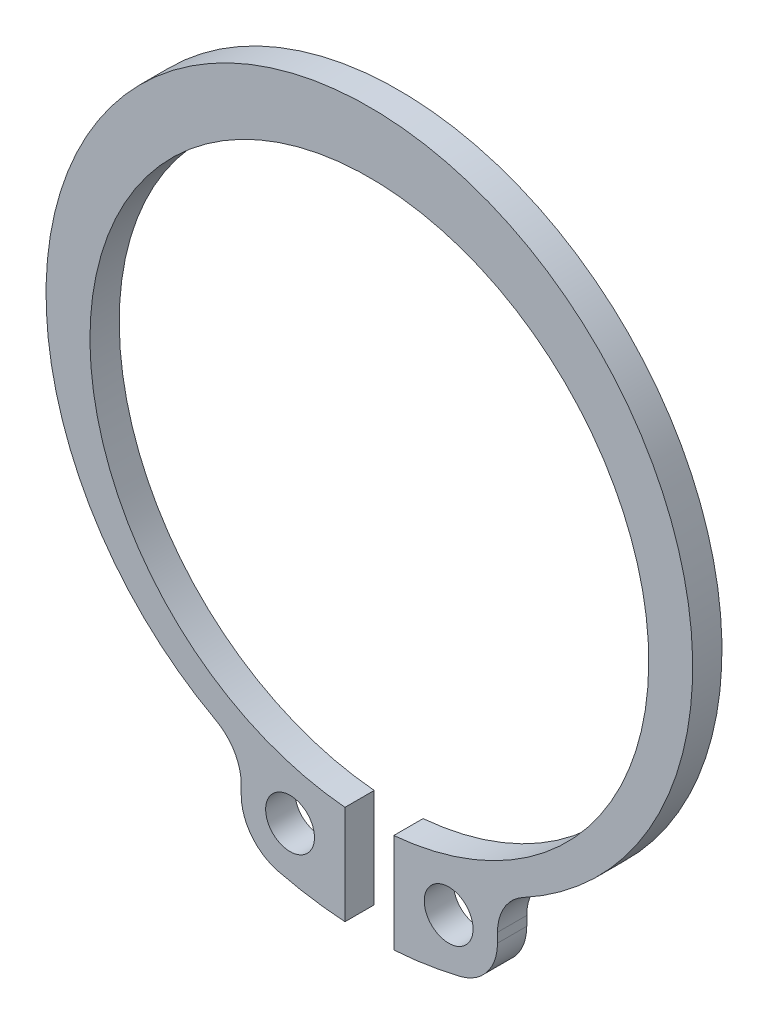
from build123d import *

# Parameters (mm, degrees)
ESQUISSE1_R          = 1
BASE_EXTRUSION_DEPTH = 1.2


with BuildPart() as part:
    # Esquisse1 → Base-Extrusion (new body)
    with BuildSketch(Plane.XY):
        with BuildLine():
            Line((-1, -11.406248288), (-1, -15.467708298))
            ThreePointArc((-1, -15.467708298), (-2.37520157, -15.316932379), (-3.731481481, -15.044136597))
            ThreePointArc((-3.731481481, -15.044136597), (-4.825271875, -14.335239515), (-5.25, -13.102957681))
            Line((-5.25, -13.102957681), (-5.25, -12.716407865))
            ThreePointArc((-5.25, -12.716407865), (-5.532204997, -11.692112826), (-6.299180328, -10.956878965))
            ThreePointArc((-6.299180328, -10.956878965), (0, 13.95), (6.299180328, -10.956878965))
            ThreePointArc((6.299180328, -10.956878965), (5.532204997, -11.692112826), (5.25, -12.716407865))
            Line((5.25, -12.716407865), (5.25, -13.102957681))
            ThreePointArc((5.25, -13.102957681), (4.825271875, -14.335239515), (3.731481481, -15.044136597))
            ThreePointArc((3.731481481, -15.044136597), (2.37520157, -15.316932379), (1, -15.467708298))
            Line((1, -15.467708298), (1, -11.406248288))
            ThreePointArc((1, -11.406248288), (0, 11.45), (-1, -11.406248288))
        make_face()
        with Locations((3.25, -13.102957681)):
            Circle(ESQUISSE1_R, mode=Mode.SUBTRACT)
        with Locations((-3.25, -13.102957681)):
            Circle(ESQUISSE1_R, mode=Mode.SUBTRACT)
    extrude(amount=BASE_EXTRUSION_DEPTH)


solid = part.part
